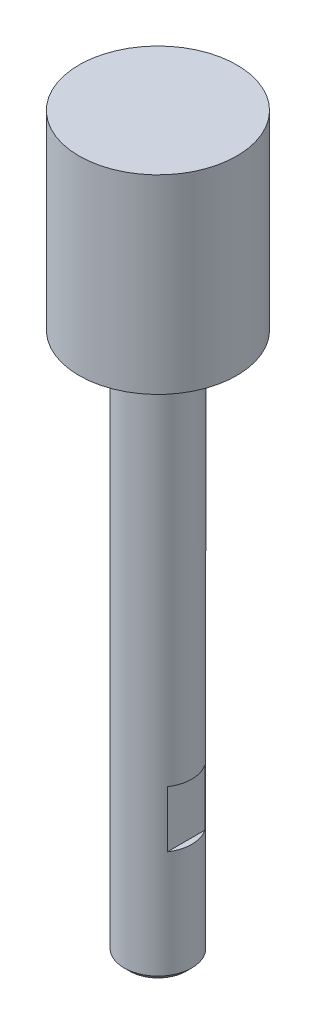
from build123d import *

# Parameters (mm, degrees)
SKETCH1_R             = 11.1125
PISTON_DEPTH          = 26.7716
SKETCH2_R             = 4.7625
ROD_DEPTH             = 76.2
WRENCHFLAT_DEPTH      = 13.1496
WRENCHFLAT_DEPTH_BACK = 13.937
SKETCH3_W             = 6.21636167
SKETCH3_H             = 7.9375
CHAMFER1_SIZE         = 0.7874


with BuildPart() as part:
    # Sketch1 → Piston (new body)
    with BuildSketch(Plane(origin=(0, 0, 0), x_dir=(1, 0, 0), z_dir=(0, 1, 0))):
        with Locations(Location((0, 0, 0), (0, 0, 270))):
            Circle(SKETCH1_R)
    extrude(amount=PISTON_DEPTH)

    # Sketch2 → Rod (add)
    with BuildSketch(Plane.XZ):
        with Locations(Location((0, 0, 0), (0, 0, 90))):
            Circle(SKETCH2_R)
    extrude(amount=ROD_DEPTH)

    # Sketch3 → WrenchFlat (cut, two sides: drawn at the far end of the back side and taken through both)
    with BuildSketch(Plane.XY.offset(-WRENCHFLAT_DEPTH_BACK)):
        with Locations((-7.075660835, -56.35625)):
            Rectangle(SKETCH3_W, SKETCH3_H)
        with Locations((7.075660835, -56.35625)):
            Rectangle(SKETCH3_W, SKETCH3_H)
    extrude(amount=WRENCHFLAT_DEPTH + WRENCHFLAT_DEPTH_BACK, mode=Mode.SUBTRACT)

    # Chamfer1
    chamfer1_edges = [part.edges().sort_by_distance(p)[0] for p in [
        (0, -76.2, -4.7625),
    ]]
    chamfer(chamfer1_edges, length=CHAMFER1_SIZE)


solid = part.part
